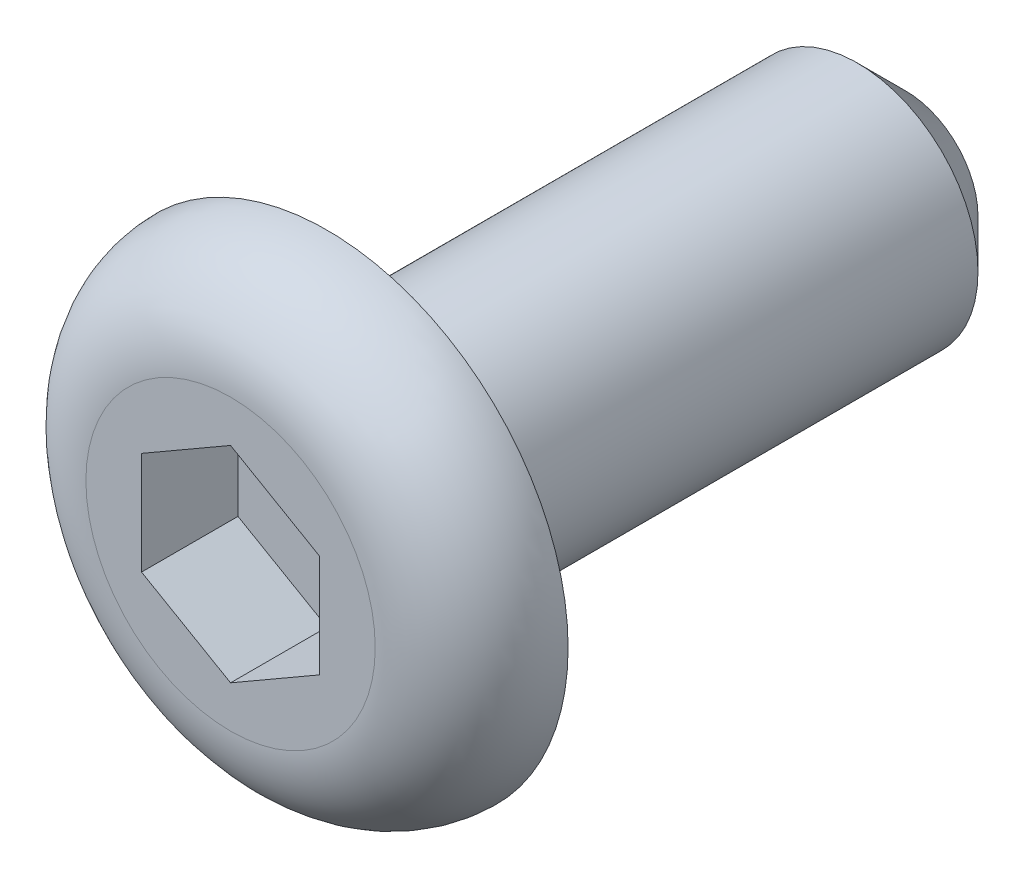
ISO-10303-21;
HEADER;
FILE_DESCRIPTION(('STEP AP214'),'2;1');
FILE_NAME('part.step','',(''),(''),'','','');
FILE_SCHEMA(('AUTOMOTIVE_DESIGN { 1 0 10303 214 1 1 1 1 }'));
ENDSEC;
DATA;
#1=APPLICATION_CONTEXT('core data for automotive mechanical design processes');
#2=APPLICATION_PROTOCOL_DEFINITION('international standard','automotive_design',2000,#1);
#3=PRODUCT_CONTEXT('',#1,'mechanical');
#4=PRODUCT('Part','Part','',(#3));
#5=PRODUCT_RELATED_PRODUCT_CATEGORY('part','',(#4));
#6=PRODUCT_DEFINITION_FORMATION('','',#4);
#7=PRODUCT_DEFINITION_CONTEXT('part definition',#1,'design');
#8=PRODUCT_DEFINITION('design','',#6,#7);
#9=PRODUCT_DEFINITION_SHAPE('','',#8);
#10=(LENGTH_UNIT() NAMED_UNIT(*) SI_UNIT(.MILLI.,.METRE.));
#11=(NAMED_UNIT(*) PLANE_ANGLE_UNIT() SI_UNIT($,.RADIAN.));
#12=(NAMED_UNIT(*) SI_UNIT($,.STERADIAN.) SOLID_ANGLE_UNIT());
#13=UNCERTAINTY_MEASURE_WITH_UNIT(LENGTH_MEASURE(1.E-05),#10,'distance_accuracy_value','');
#14=(GEOMETRIC_REPRESENTATION_CONTEXT(3) GLOBAL_UNCERTAINTY_ASSIGNED_CONTEXT((#13)) GLOBAL_UNIT_ASSIGNED_CONTEXT((#10,
#11,#12)) REPRESENTATION_CONTEXT('',''));
#15=CARTESIAN_POINT('',(0.,0.,0.));
#16=DIRECTION('',(0.,0.,1.));
#17=DIRECTION('',(1.,0.,0.));
#18=AXIS2_PLACEMENT_3D('',#15,#16,#17);
#19=CARTESIAN_POINT('',(-10.8900369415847,3.08761918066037,-6.));
#20=DIRECTION('',(0.,0.,1.));
#21=DIRECTION('',(1.,0.,0.));
#22=AXIS2_PLACEMENT_3D('',#19,#20,#21);
#23=CYLINDRICAL_SURFACE('',#22,1.25);
#24=CARTESIAN_POINT('',(-10.8900369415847,3.08761918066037,-5.5));
#25=DIRECTION('',(0.,0.,1.));
#26=DIRECTION('',(1.,0.,0.));
#27=AXIS2_PLACEMENT_3D('',#24,#25,#26);
#28=CIRCLE('',#27,1.25);
#29=CARTESIAN_POINT('',(-9.64003694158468,3.08761918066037,-5.5));
#30=VERTEX_POINT('',#29);
#31=EDGE_CURVE('E47',#30,#30,#28,.T.);
#32=ORIENTED_EDGE('',*,*,#31,.T.);
#33=EDGE_LOOP('',(#32));
#34=FACE_BOUND('',#33,.T.);
#35=CARTESIAN_POINT('',(-10.8900369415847,3.08761918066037,0.));
#36=DIRECTION('',(0.,0.,1.));
#37=DIRECTION('',(1.,0.,0.));
#38=AXIS2_PLACEMENT_3D('',#35,#36,#37);
#39=CIRCLE('',#38,1.25);
#40=CARTESIAN_POINT('',(-9.64003694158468,3.08761918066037,0.));
#41=VERTEX_POINT('',#40);
#42=EDGE_CURVE('E149',#41,#41,#39,.T.);
#43=ORIENTED_EDGE('',*,*,#42,.F.);
#44=EDGE_LOOP('',(#43));
#45=FACE_BOUND('',#44,.T.);
#46=ADVANCED_FACE('F39',(#34,#45),#23,.T.);
#47=CARTESIAN_POINT('',(-10.8900369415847,3.08761918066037,-6.));
#48=DIRECTION('',(0.,0.,1.));
#49=DIRECTION('',(1.,0.,0.));
#50=AXIS2_PLACEMENT_3D('',#47,#48,#49);
#51=PLANE('',#50);
#52=CARTESIAN_POINT('',(-10.8900369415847,3.08761918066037,-6.));
#53=DIRECTION('',(0.,0.,1.));
#54=DIRECTION('',(1.,0.,0.));
#55=AXIS2_PLACEMENT_3D('',#52,#53,#54);
#56=CIRCLE('',#55,0.749999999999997);
#57=CARTESIAN_POINT('',(-10.1400369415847,3.08761918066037,-6.));
#58=VERTEX_POINT('',#57);
#59=EDGE_CURVE('E11',#58,#58,#56,.F.);
#60=ORIENTED_EDGE('',*,*,#59,.T.);
#61=EDGE_LOOP('',(#60));
#62=FACE_BOUND('',#61,.T.);
#63=ADVANCED_FACE('F168',(#62),#51,.F.);
#64=CARTESIAN_POINT('',(-10.8900369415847,3.08761918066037,1.));
#65=DIRECTION('',(0.,0.,1.));
#66=DIRECTION('',(1.,0.,0.));
#67=AXIS2_PLACEMENT_3D('',#64,#65,#66);
#68=PLANE('',#67);
#69=CARTESIAN_POINT('',(-10.8900369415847,3.08761918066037,1.));
#70=DIRECTION('',(0.,0.,1.));
#71=DIRECTION('',(1.,0.,0.));
#72=AXIS2_PLACEMENT_3D('',#69,#70,#71);
#73=CIRCLE('',#72,1.5);
#74=CARTESIAN_POINT('',(-9.39003694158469,3.08761918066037,1.));
#75=VERTEX_POINT('',#74);
#76=EDGE_CURVE('E152',#75,#75,#73,.T.);
#77=ORIENTED_EDGE('',*,*,#76,.T.);
#78=EDGE_LOOP('',(#77));
#79=FACE_BOUND('',#78,.T.);
#80=DIRECTION('',(-0.866025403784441,0.499999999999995,0.));
#81=VECTOR('',#80,1.);
#82=CARTESIAN_POINT('',(-9.96701507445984,3.62052610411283,1.));
#83=LINE('',#82,#81);
#84=CARTESIAN_POINT('',(-9.96701507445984,3.62052610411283,1.));
#85=VERTEX_POINT('',#84);
#86=CARTESIAN_POINT('',(-10.8900369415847,4.15343302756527,1.));
#87=VERTEX_POINT('',#86);
#88=EDGE_CURVE('E54',#85,#87,#83,.T.);
#89=ORIENTED_EDGE('',*,*,#88,.F.);
#90=DIRECTION('',(0.,1.,0.));
#91=VECTOR('',#90,1.);
#92=CARTESIAN_POINT('',(-9.96701507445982,2.55471225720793,1.));
#93=LINE('',#92,#91);
#94=CARTESIAN_POINT('',(-9.96701507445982,2.55471225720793,1.));
#95=VERTEX_POINT('',#94);
#96=EDGE_CURVE('E137',#95,#85,#93,.T.);
#97=ORIENTED_EDGE('',*,*,#96,.F.);
#98=DIRECTION('',(0.866025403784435,0.500000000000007,0.));
#99=VECTOR('',#98,1.);
#100=CARTESIAN_POINT('',(-10.8900369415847,2.02180533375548,1.));
#101=LINE('',#100,#99);
#102=CARTESIAN_POINT('',(-10.8900369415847,2.02180533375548,1.));
#103=VERTEX_POINT('',#102);
#104=EDGE_CURVE('E135',#103,#95,#101,.T.);
#105=ORIENTED_EDGE('',*,*,#104,.F.);
#106=DIRECTION('',(0.866025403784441,-0.499999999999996,0.));
#107=VECTOR('',#106,1.);
#108=CARTESIAN_POINT('',(-11.8130588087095,2.55471225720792,1.));
#109=LINE('',#108,#107);
#110=CARTESIAN_POINT('',(-11.8130588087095,2.55471225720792,1.));
#111=VERTEX_POINT('',#110);
#112=EDGE_CURVE('E102',#111,#103,#109,.T.);
#113=ORIENTED_EDGE('',*,*,#112,.F.);
#114=DIRECTION('',(0.,-1.,0.));
#115=VECTOR('',#114,1.);
#116=CARTESIAN_POINT('',(-11.8130588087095,3.62052610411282,1.));
#117=LINE('',#116,#115);
#118=CARTESIAN_POINT('',(-11.8130588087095,3.62052610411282,1.));
#119=VERTEX_POINT('',#118);
#120=EDGE_CURVE('E131',#119,#111,#117,.T.);
#121=ORIENTED_EDGE('',*,*,#120,.F.);
#122=DIRECTION('',(-0.866025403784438,-0.500000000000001,0.));
#123=VECTOR('',#122,1.);
#124=CARTESIAN_POINT('',(-10.8900369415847,4.15343302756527,1.));
#125=LINE('',#124,#123);
#126=EDGE_CURVE('E128',#87,#119,#125,.T.);
#127=ORIENTED_EDGE('',*,*,#126,.F.);
#128=EDGE_LOOP('',(#89,#97,#105,#113,#121,#127));
#129=FACE_BOUND('',#128,.T.);
#130=ADVANCED_FACE('F173',(#79,#129),#68,.T.);
#131=CARTESIAN_POINT('',(-10.8900369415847,3.08761918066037,0.));
#132=DIRECTION('',(0.,0.,1.));
#133=DIRECTION('',(1.,0.,0.));
#134=AXIS2_PLACEMENT_3D('',#131,#132,#133);
#135=PLANE('',#134);
#136=ORIENTED_EDGE('',*,*,#42,.T.);
#137=EDGE_LOOP('',(#136));
#138=FACE_BOUND('',#137,.T.);
#139=CARTESIAN_POINT('',(-10.8900369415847,3.08761918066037,0.));
#140=DIRECTION('',(0.,0.,1.));
#141=DIRECTION('',(1.,0.,0.));
#142=AXIS2_PLACEMENT_3D('',#139,#140,#141);
#143=CIRCLE('',#142,2.5);
#144=CARTESIAN_POINT('',(-8.39003694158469,3.08761918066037,0.));
#145=VERTEX_POINT('',#144);
#146=EDGE_CURVE('E141',#145,#145,#143,.T.);
#147=ORIENTED_EDGE('',*,*,#146,.F.);
#148=EDGE_LOOP('',(#147));
#149=FACE_BOUND('',#148,.T.);
#150=ADVANCED_FACE('F177',(#138,#149),#135,.F.);
#151=CARTESIAN_POINT('',(-9.96701507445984,3.62052610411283,0.));
#152=DIRECTION('',(0.499999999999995,0.866025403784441,0.));
#153=DIRECTION('',(-0.866025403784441,0.499999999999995,0.));
#154=AXIS2_PLACEMENT_3D('',#151,#152,#153);
#155=PLANE('',#154);
#156=ORIENTED_EDGE('',*,*,#88,.T.);
#157=DIRECTION('',(0.,0.,1.));
#158=VECTOR('',#157,1.);
#159=CARTESIAN_POINT('',(-10.8900369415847,4.15343302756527,0.));
#160=LINE('',#159,#158);
#161=CARTESIAN_POINT('',(-10.8900369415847,4.15343302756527,0.));
#162=VERTEX_POINT('',#161);
#163=EDGE_CURVE('E84',#162,#87,#160,.T.);
#164=ORIENTED_EDGE('',*,*,#163,.F.);
#165=DIRECTION('',(-0.866025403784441,0.499999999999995,0.));
#166=VECTOR('',#165,1.);
#167=CARTESIAN_POINT('',(-9.96701507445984,3.62052610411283,0.));
#168=LINE('',#167,#166);
#169=CARTESIAN_POINT('',(-9.96701507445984,3.62052610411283,0.));
#170=VERTEX_POINT('',#169);
#171=EDGE_CURVE('E139',#170,#162,#168,.T.);
#172=ORIENTED_EDGE('',*,*,#171,.F.);
#173=DIRECTION('',(0.,0.,1.));
#174=VECTOR('',#173,1.);
#175=CARTESIAN_POINT('',(-9.96701507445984,3.62052610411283,0.));
#176=LINE('',#175,#174);
#177=EDGE_CURVE('E62',#170,#85,#176,.T.);
#178=ORIENTED_EDGE('',*,*,#177,.T.);
#179=EDGE_LOOP('',(#156,#164,#172,#178));
#180=FACE_BOUND('',#179,.T.);
#181=ADVANCED_FACE('F180',(#180),#155,.F.);
#182=CARTESIAN_POINT('',(-9.96701507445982,2.55471225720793,0.));
#183=DIRECTION('',(1.,0.,0.));
#184=DIRECTION('',(0.,1.,0.));
#185=AXIS2_PLACEMENT_3D('',#182,#183,#184);
#186=PLANE('',#185);
#187=ORIENTED_EDGE('',*,*,#96,.T.);
#188=ORIENTED_EDGE('',*,*,#177,.F.);
#189=DIRECTION('',(0.,1.,0.));
#190=VECTOR('',#189,1.);
#191=CARTESIAN_POINT('',(-9.96701507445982,2.55471225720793,0.));
#192=LINE('',#191,#190);
#193=CARTESIAN_POINT('',(-9.96701507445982,2.55471225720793,0.));
#194=VERTEX_POINT('',#193);
#195=EDGE_CURVE('E114',#194,#170,#192,.T.);
#196=ORIENTED_EDGE('',*,*,#195,.F.);
#197=DIRECTION('',(0.,0.,1.));
#198=VECTOR('',#197,1.);
#199=CARTESIAN_POINT('',(-9.96701507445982,2.55471225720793,0.));
#200=LINE('',#199,#198);
#201=EDGE_CURVE('E106',#194,#95,#200,.T.);
#202=ORIENTED_EDGE('',*,*,#201,.T.);
#203=EDGE_LOOP('',(#187,#188,#196,#202));
#204=FACE_BOUND('',#203,.T.);
#205=ADVANCED_FACE('F187',(#204),#186,.F.);
#206=CARTESIAN_POINT('',(-10.8900369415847,2.02180533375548,0.));
#207=DIRECTION('',(0.500000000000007,-0.866025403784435,0.));
#208=DIRECTION('',(0.866025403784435,0.500000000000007,0.));
#209=AXIS2_PLACEMENT_3D('',#206,#207,#208);
#210=PLANE('',#209);
#211=ORIENTED_EDGE('',*,*,#104,.T.);
#212=ORIENTED_EDGE('',*,*,#201,.F.);
#213=DIRECTION('',(0.866025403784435,0.500000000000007,0.));
#214=VECTOR('',#213,1.);
#215=CARTESIAN_POINT('',(-10.8900369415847,2.02180533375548,0.));
#216=LINE('',#215,#214);
#217=CARTESIAN_POINT('',(-10.8900369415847,2.02180533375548,0.));
#218=VERTEX_POINT('',#217);
#219=EDGE_CURVE('E110',#218,#194,#216,.T.);
#220=ORIENTED_EDGE('',*,*,#219,.F.);
#221=DIRECTION('',(0.,0.,1.));
#222=VECTOR('',#221,1.);
#223=CARTESIAN_POINT('',(-10.8900369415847,2.02180533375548,0.));
#224=LINE('',#223,#222);
#225=EDGE_CURVE('E95',#218,#103,#224,.T.);
#226=ORIENTED_EDGE('',*,*,#225,.T.);
#227=EDGE_LOOP('',(#211,#212,#220,#226));
#228=FACE_BOUND('',#227,.T.);
#229=ADVANCED_FACE('F111',(#228),#210,.F.);
#230=CARTESIAN_POINT('',(-11.8130588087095,2.55471225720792,0.));
#231=DIRECTION('',(-0.499999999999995,-0.866025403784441,0.));
#232=DIRECTION('',(0.866025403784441,-0.499999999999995,0.));
#233=AXIS2_PLACEMENT_3D('',#230,#231,#232);
#234=PLANE('',#233);
#235=ORIENTED_EDGE('',*,*,#112,.T.);
#236=ORIENTED_EDGE('',*,*,#225,.F.);
#237=DIRECTION('',(0.866025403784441,-0.499999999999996,0.));
#238=VECTOR('',#237,1.);
#239=CARTESIAN_POINT('',(-11.8130588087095,2.55471225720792,0.));
#240=LINE('',#239,#238);
#241=CARTESIAN_POINT('',(-11.8130588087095,2.55471225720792,0.));
#242=VERTEX_POINT('',#241);
#243=EDGE_CURVE('E99',#242,#218,#240,.T.);
#244=ORIENTED_EDGE('',*,*,#243,.F.);
#245=DIRECTION('',(0.,0.,1.));
#246=VECTOR('',#245,1.);
#247=CARTESIAN_POINT('',(-11.8130588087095,2.55471225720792,0.));
#248=LINE('',#247,#246);
#249=EDGE_CURVE('E107',#242,#111,#248,.T.);
#250=ORIENTED_EDGE('',*,*,#249,.T.);
#251=EDGE_LOOP('',(#235,#236,#244,#250));
#252=FACE_BOUND('',#251,.T.);
#253=ADVANCED_FACE('F97',(#252),#234,.F.);
#254=CARTESIAN_POINT('',(-11.8130588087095,3.62052610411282,0.));
#255=DIRECTION('',(-1.,0.,0.));
#256=DIRECTION('',(0.,-1.,0.));
#257=AXIS2_PLACEMENT_3D('',#254,#255,#256);
#258=PLANE('',#257);
#259=ORIENTED_EDGE('',*,*,#120,.T.);
#260=ORIENTED_EDGE('',*,*,#249,.F.);
#261=DIRECTION('',(0.,-1.,0.));
#262=VECTOR('',#261,1.);
#263=CARTESIAN_POINT('',(-11.8130588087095,3.62052610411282,0.));
#264=LINE('',#263,#262);
#265=CARTESIAN_POINT('',(-11.8130588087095,3.62052610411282,0.));
#266=VERTEX_POINT('',#265);
#267=EDGE_CURVE('E120',#266,#242,#264,.T.);
#268=ORIENTED_EDGE('',*,*,#267,.F.);
#269=DIRECTION('',(0.,0.,1.));
#270=VECTOR('',#269,1.);
#271=CARTESIAN_POINT('',(-11.8130588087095,3.62052610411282,0.));
#272=LINE('',#271,#270);
#273=EDGE_CURVE('E144',#266,#119,#272,.T.);
#274=ORIENTED_EDGE('',*,*,#273,.T.);
#275=EDGE_LOOP('',(#259,#260,#268,#274));
#276=FACE_BOUND('',#275,.T.);
#277=ADVANCED_FACE('F191',(#276),#258,.F.);
#278=CARTESIAN_POINT('',(-10.8900369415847,4.15343302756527,0.));
#279=DIRECTION('',(-0.500000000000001,0.866025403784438,0.));
#280=DIRECTION('',(-0.866025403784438,-0.500000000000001,0.));
#281=AXIS2_PLACEMENT_3D('',#278,#279,#280);
#282=PLANE('',#281);
#283=ORIENTED_EDGE('',*,*,#126,.T.);
#284=ORIENTED_EDGE('',*,*,#273,.F.);
#285=DIRECTION('',(-0.866025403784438,-0.500000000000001,0.));
#286=VECTOR('',#285,1.);
#287=CARTESIAN_POINT('',(-10.8900369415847,4.15343302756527,0.));
#288=LINE('',#287,#286);
#289=EDGE_CURVE('E122',#162,#266,#288,.T.);
#290=ORIENTED_EDGE('',*,*,#289,.F.);
#291=ORIENTED_EDGE('',*,*,#163,.T.);
#292=EDGE_LOOP('',(#283,#284,#290,#291));
#293=FACE_BOUND('',#292,.T.);
#294=ADVANCED_FACE('F188',(#293),#282,.F.);
#295=CARTESIAN_POINT('',(0.,0.,0.));
#296=DIRECTION('',(0.,0.,1.));
#297=DIRECTION('',(1.,0.,0.));
#298=AXIS2_PLACEMENT_3D('',#295,#296,#297);
#299=PLANE('',#298);
#300=ORIENTED_EDGE('',*,*,#171,.T.);
#301=ORIENTED_EDGE('',*,*,#289,.T.);
#302=ORIENTED_EDGE('',*,*,#267,.T.);
#303=ORIENTED_EDGE('',*,*,#243,.T.);
#304=ORIENTED_EDGE('',*,*,#219,.T.);
#305=ORIENTED_EDGE('',*,*,#195,.T.);
#306=EDGE_LOOP('',(#300,#301,#302,#303,#304,#305));
#307=FACE_BOUND('',#306,.T.);
#308=ADVANCED_FACE('F117',(#307),#299,.T.);
#309=CARTESIAN_POINT('',(-10.8900369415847,3.08761918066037,0.));
#310=DIRECTION('',(0.,0.,1.));
#311=DIRECTION('',(1.,0.,0.));
#312=AXIS2_PLACEMENT_3D('',#309,#310,#311);
#313=TOROIDAL_SURFACE('',#312,1.5,1.);
#314=ORIENTED_EDGE('',*,*,#146,.T.);
#315=EDGE_LOOP('',(#314));
#316=FACE_BOUND('',#315,.T.);
#317=ORIENTED_EDGE('',*,*,#76,.F.);
#318=EDGE_LOOP('',(#317));
#319=FACE_BOUND('',#318,.T.);
#320=ADVANCED_FACE('F160',(#316,#319),#313,.T.);
#321=CARTESIAN_POINT('',(-10.8900369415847,3.08761918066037,-5.5));
#322=DIRECTION('',(0.,0.,1.));
#323=DIRECTION('',(1.,0.,0.));
#324=AXIS2_PLACEMENT_3D('',#321,#322,#323);
#325=CONICAL_SURFACE('',#324,1.25,0.78539816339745);
#326=ORIENTED_EDGE('',*,*,#59,.F.);
#327=EDGE_LOOP('',(#326));
#328=FACE_BOUND('',#327,.T.);
#329=ORIENTED_EDGE('',*,*,#31,.F.);
#330=EDGE_LOOP('',(#329));
#331=FACE_BOUND('',#330,.T.);
#332=ADVANCED_FACE('F41',(#328,#331),#325,.T.);
#333=CLOSED_SHELL('',(#46,#63,#130,#150,#181,#205,#229,#253,#277,#294,#308,#320,#332));
#334=MANIFOLD_SOLID_BREP('B2',#333);
#335=ADVANCED_BREP_SHAPE_REPRESENTATION('',(#18,#334),#14);
#336=SHAPE_DEFINITION_REPRESENTATION(#9,#335);
ENDSEC;
END-ISO-10303-21;
